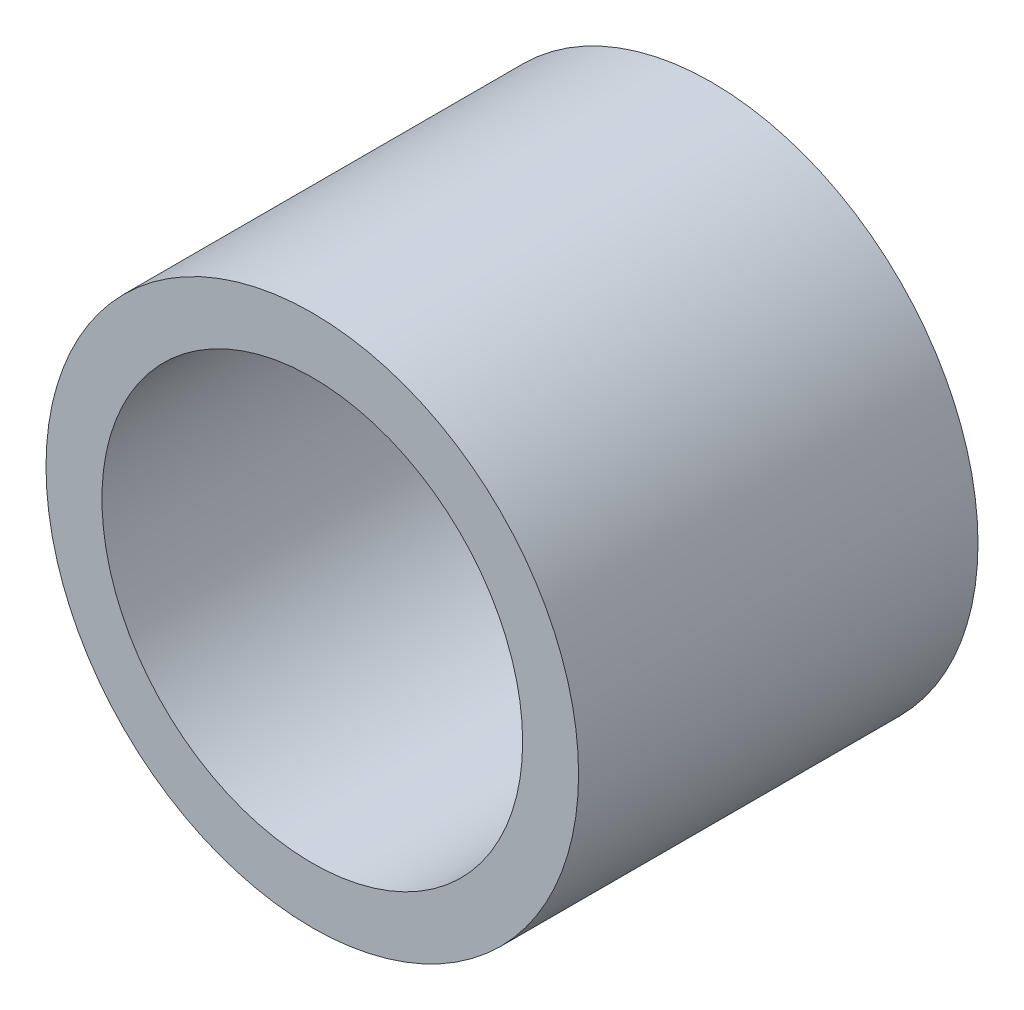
from build123d import *

# Parameters (mm, degrees)
SKETCH_1_R          = 10
EXTRUDE_1_DEPTH     = 15
SKETCH_2_R          = 7.9
CUT_EXTRUDE_1_DEPTH = 21.615528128


with BuildPart() as part:
    # Sketch 1 → Extrude 1 (new body)
    with BuildSketch(Plane.XY):
        Circle(SKETCH_1_R)
    extrude(amount=EXTRUDE_1_DEPTH)

    # Sketch 2 → Cut-Extrude 1 (cut, through all)
    with BuildSketch(Plane.XY):
        Circle(SKETCH_2_R)
    extrude(amount=CUT_EXTRUDE_1_DEPTH, mode=Mode.SUBTRACT)


solid = part.part
